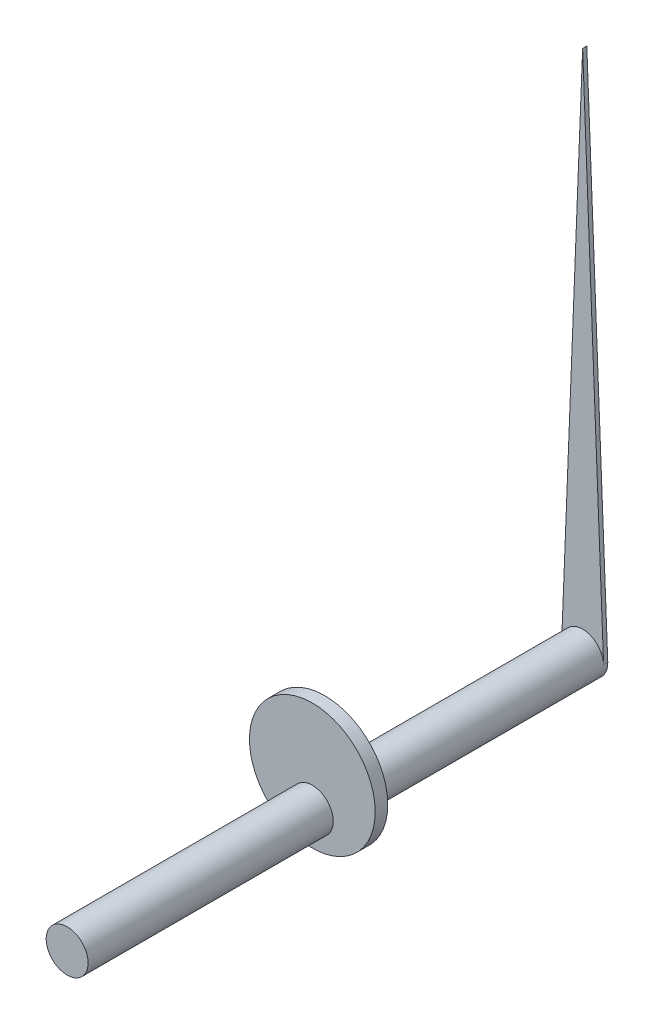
from build123d import *

# Parameters (mm, degrees)
SKETCH1_R         = 5
SHAFT_DEPTH       = 61.5
SKETCH2_R         = 15
ECCENTRIC_DEPTH   = 3
MINUTE_HAND_DEPTH = 1


with BuildPart() as part:
    # Sketch1 → Shaft (new, symmetric)
    with BuildSketch(Plane.XY):
        Circle(SKETCH1_R)
    extrude(amount=SHAFT_DEPTH, both=True)

    # Sketch2 → Eccentric (add)
    with BuildSketch(Plane.XY):
        with Locations((0, 7)):
            Circle(SKETCH2_R)
    extrude(amount=ECCENTRIC_DEPTH)

    # Sketch3 → Minute Hand (add)
    with BuildSketch(Plane(origin=(0, 0, -61.5), x_dir=(-1, 0, 0), z_dir=(0, 0, -1))):
        with BuildLine():
            Line((-4.995998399, 0.2), (0, 125))
            Line((0, 125), (4.995998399, 0.2))
            ThreePointArc((4.995998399, 0.2), (0, -5), (-4.995998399, 0.2))
        make_face()
    extrude(amount=MINUTE_HAND_DEPTH)


solid = part.part
